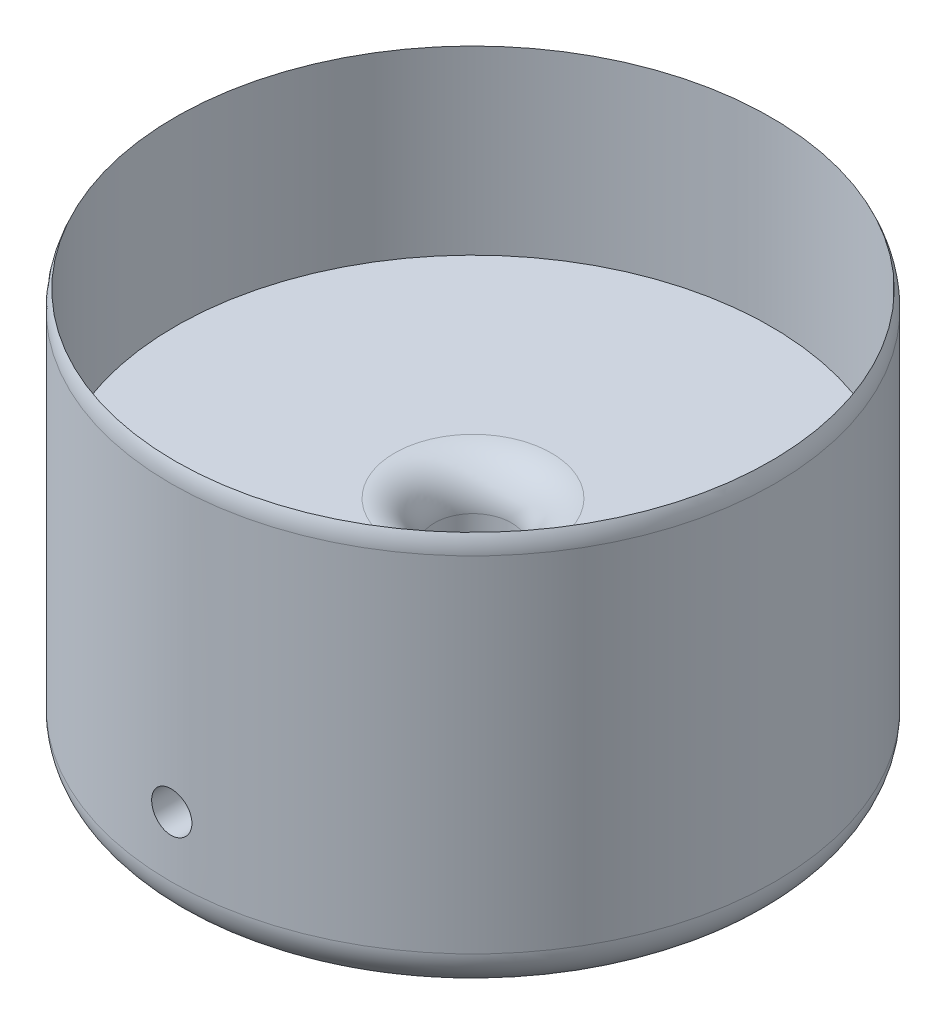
ISO-10303-21;
HEADER;
FILE_DESCRIPTION(('STEP AP214'),'2;1');
FILE_NAME('part.step','',(''),(''),'','','');
FILE_SCHEMA(('AUTOMOTIVE_DESIGN { 1 0 10303 214 1 1 1 1 }'));
ENDSEC;
DATA;
#1=APPLICATION_CONTEXT('core data for automotive mechanical design processes');
#2=APPLICATION_PROTOCOL_DEFINITION('international standard','automotive_design',2000,#1);
#3=PRODUCT_CONTEXT('',#1,'mechanical');
#4=PRODUCT('Part','Part','',(#3));
#5=PRODUCT_RELATED_PRODUCT_CATEGORY('part','',(#4));
#6=PRODUCT_DEFINITION_FORMATION('','',#4);
#7=PRODUCT_DEFINITION_CONTEXT('part definition',#1,'design');
#8=PRODUCT_DEFINITION('design','',#6,#7);
#9=PRODUCT_DEFINITION_SHAPE('','',#8);
#10=(LENGTH_UNIT() NAMED_UNIT(*) SI_UNIT(.MILLI.,.METRE.));
#11=(NAMED_UNIT(*) PLANE_ANGLE_UNIT() SI_UNIT($,.RADIAN.));
#12=(NAMED_UNIT(*) SI_UNIT($,.STERADIAN.) SOLID_ANGLE_UNIT());
#13=UNCERTAINTY_MEASURE_WITH_UNIT(LENGTH_MEASURE(1.E-05),#10,'distance_accuracy_value','');
#14=(GEOMETRIC_REPRESENTATION_CONTEXT(3) GLOBAL_UNCERTAINTY_ASSIGNED_CONTEXT((#13)) GLOBAL_UNIT_ASSIGNED_CONTEXT((#10,
#11,#12)) REPRESENTATION_CONTEXT('',''));
#15=CARTESIAN_POINT('',(0.,0.,0.));
#16=DIRECTION('',(0.,0.,1.));
#17=DIRECTION('',(1.,0.,0.));
#18=AXIS2_PLACEMENT_3D('',#15,#16,#17);
#19=CARTESIAN_POINT('',(0.,100.,0.));
#20=DIRECTION('',(0.,-1.,0.));
#21=DIRECTION('',(0.,0.,-1.));
#22=AXIS2_PLACEMENT_3D('',#19,#20,#21);
#23=CYLINDRICAL_SURFACE('',#22,75.);
#24=CARTESIAN_POINT('',(0.,30.0000000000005,-75.));
#25=CARTESIAN_POINT('',(-0.140309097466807,30.0000011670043,-75.0000002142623));
#26=CARTESIAN_POINT('',(-0.280599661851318,29.9940916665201,-74.9996054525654));
#27=CARTESIAN_POINT('',(-0.56022812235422,29.9704960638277,-74.9980378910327));
#28=CARTESIAN_POINT('',(-0.699565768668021,29.9528069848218,-74.9968648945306));
#29=CARTESIAN_POINT('',(-0.976366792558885,29.9057552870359,-74.9937723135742));
#30=CARTESIAN_POINT('',(-1.11382847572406,29.8763827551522,-74.9918520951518));
#31=CARTESIAN_POINT('',(-1.38583180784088,29.8061633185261,-74.9873187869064));
#32=CARTESIAN_POINT('',(-1.52037236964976,29.7653122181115,-74.9847054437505));
#33=CARTESIAN_POINT('',(-1.7854045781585,29.6724755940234,-74.9788629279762));
#34=CARTESIAN_POINT('',(-1.91589977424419,29.6205001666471,-74.975634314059));
#35=CARTESIAN_POINT('',(-2.17209218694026,29.5057434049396,-74.968649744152));
#36=CARTESIAN_POINT('',(-2.29778761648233,29.4429580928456,-74.9648935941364));
#37=CARTESIAN_POINT('',(-2.54336741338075,29.3070829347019,-74.9569634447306));
#38=CARTESIAN_POINT('',(-2.66325520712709,29.2339992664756,-74.9527896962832));
#39=CARTESIAN_POINT('',(-2.89649799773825,29.0779887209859,-74.9441387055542));
#40=CARTESIAN_POINT('',(-3.00985056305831,28.9950582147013,-74.9396613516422));
#41=CARTESIAN_POINT('',(-3.22929868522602,28.8198644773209,-74.9305258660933));
#42=CARTESIAN_POINT('',(-3.33538597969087,28.7275909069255,-74.9258675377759));
#43=CARTESIAN_POINT('',(-3.53945256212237,28.5344057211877,-74.9165049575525));
#44=CARTESIAN_POINT('',(-3.63742884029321,28.4334909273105,-74.9118006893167));
#45=CARTESIAN_POINT('',(-3.82450593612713,28.2238005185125,-74.9024827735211));
#46=CARTESIAN_POINT('',(-3.9136096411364,28.115027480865,-74.8978690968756));
#47=CARTESIAN_POINT('',(-4.08237803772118,27.8903185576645,-74.8888598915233));
#48=CARTESIAN_POINT('',(-4.16203923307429,27.7743800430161,-74.8844644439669));
#49=CARTESIAN_POINT('',(-4.31135978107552,27.5361292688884,-74.8760160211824));
#50=CARTESIAN_POINT('',(-4.38101356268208,27.4138135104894,-74.8719632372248));
#51=CARTESIAN_POINT('',(-4.50979330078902,27.1636916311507,-74.8643167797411));
#52=CARTESIAN_POINT('',(-4.56891535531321,27.0358834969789,-74.860723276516));
#53=CARTESIAN_POINT('',(-4.67615623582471,26.7757632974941,-74.8541011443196));
#54=CARTESIAN_POINT('',(-4.72427922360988,26.6434529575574,-74.8510723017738));
#55=CARTESIAN_POINT('',(-4.80921896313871,26.3752242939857,-74.8456625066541));
#56=CARTESIAN_POINT('',(-4.84603154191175,26.2393046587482,-74.843281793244));
#57=CARTESIAN_POINT('',(-4.93892346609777,25.8280860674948,-74.8372307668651));
#58=CARTESIAN_POINT('',(-4.97773600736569,25.5486487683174,-74.8346337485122));
#59=CARTESIAN_POINT('',(-5.00788806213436,24.9873661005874,-74.8326215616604));
#60=CARTESIAN_POINT('',(-4.99922817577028,24.7055207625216,-74.8332063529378));
#61=CARTESIAN_POINT('',(-4.93480047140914,24.1477119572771,-74.8374824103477));
#62=CARTESIAN_POINT('',(-4.87910802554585,23.8717398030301,-74.841168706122));
#63=CARTESIAN_POINT('',(-4.72229658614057,23.3330805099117,-74.851225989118));
#64=CARTESIAN_POINT('',(-4.62117728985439,23.0703934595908,-74.8575969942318));
#65=CARTESIAN_POINT('',(-4.37630158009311,22.5655059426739,-74.8723110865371));
#66=CARTESIAN_POINT('',(-4.232511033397,22.3233220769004,-74.8806557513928));
#67=CARTESIAN_POINT('',(-3.90639803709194,21.8665007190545,-74.8983753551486));
#68=CARTESIAN_POINT('',(-3.72407509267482,21.6518635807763,-74.9077503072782));
#69=CARTESIAN_POINT('',(-3.32564878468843,21.2557888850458,-74.9264960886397));
#70=CARTESIAN_POINT('',(-3.1094801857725,21.0744169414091,-74.9358668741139));
#71=CARTESIAN_POINT('',(-2.64972721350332,20.7505276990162,-74.9535307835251));
#72=CARTESIAN_POINT('',(-2.4061428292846,20.608010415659,-74.9618239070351));
#73=CARTESIAN_POINT('',(-1.89843247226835,20.3658812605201,-74.9763988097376));
#74=CARTESIAN_POINT('',(-1.63430527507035,20.2662719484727,-74.9826804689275));
#75=CARTESIAN_POINT('',(-1.09302498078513,20.1128305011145,-74.9925230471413));
#76=CARTESIAN_POINT('',(-0.815872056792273,20.0589977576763,-74.9960840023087));
#77=CARTESIAN_POINT('',(-0.256976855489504,19.9987190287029,-75.0000792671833));
#78=CARTESIAN_POINT('',(0.0247555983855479,19.9921823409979,-75.0005195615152));
#79=CARTESIAN_POINT('',(0.58531285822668,20.0264441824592,-74.9982398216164));
#80=CARTESIAN_POINT('',(0.864137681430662,20.0672424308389,-74.9955198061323));
#81=CARTESIAN_POINT('',(1.41070880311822,20.1949408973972,-74.9872294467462));
#82=CARTESIAN_POINT('',(1.67846488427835,20.2817994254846,-74.9816616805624));
#83=CARTESIAN_POINT('',(2.1956000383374,20.4991105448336,-74.9683020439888));
#84=CARTESIAN_POINT('',(2.44497892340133,20.6295635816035,-74.9605101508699));
#85=CARTESIAN_POINT('',(2.91869566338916,20.9305907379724,-74.9435624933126));
#86=CARTESIAN_POINT('',(3.14299500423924,21.1012253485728,-74.9344046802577));
#87=CARTESIAN_POINT('',(3.55979761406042,21.4776850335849,-74.915762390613));
#88=CARTESIAN_POINT('',(3.75230052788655,21.6835105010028,-74.9062779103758));
#89=CARTESIAN_POINT('',(4.10035416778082,22.1248972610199,-74.8880337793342));
#90=CARTESIAN_POINT('',(4.25584598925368,22.3605050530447,-74.8792752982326));
#91=CARTESIAN_POINT('',(4.52505903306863,22.85454907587,-74.8634898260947));
#92=CARTESIAN_POINT('',(4.63878054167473,23.1129851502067,-74.8564628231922));
#93=CARTESIAN_POINT('',(4.82112861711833,23.6450835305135,-74.8449403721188));
#94=CARTESIAN_POINT('',(4.88979207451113,23.9187331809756,-74.8404428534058));
#95=CARTESIAN_POINT('',(4.98017484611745,24.4738611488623,-74.834484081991));
#96=CARTESIAN_POINT('',(5.00189470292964,24.755339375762,-74.8330227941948));
#97=CARTESIAN_POINT('',(4.99885527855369,25.176740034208,-74.8332233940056));
#98=CARTESIAN_POINT('',(4.99191643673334,25.3170094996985,-74.8336882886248));
#99=CARTESIAN_POINT('',(4.96627572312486,25.5964503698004,-74.8353947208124));
#100=CARTESIAN_POINT('',(4.94757820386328,25.7356221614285,-74.8366359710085));
#101=CARTESIAN_POINT('',(4.89854032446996,26.0119332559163,-74.8398616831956));
#102=CARTESIAN_POINT('',(4.86819566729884,26.1490717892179,-74.8418464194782));
#103=CARTESIAN_POINT('',(4.79609789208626,26.4202530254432,-74.8465012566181));
#104=CARTESIAN_POINT('',(4.75434896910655,26.5542968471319,-74.8491711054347));
#105=CARTESIAN_POINT('',(4.65971948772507,26.8184342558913,-74.8551218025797));
#106=CARTESIAN_POINT('',(4.60683502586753,26.948526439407,-74.8584028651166));
#107=CARTESIAN_POINT('',(4.49034262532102,27.2037450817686,-74.8654808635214));
#108=CARTESIAN_POINT('',(4.42673863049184,27.3288733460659,-74.8692776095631));
#109=CARTESIAN_POINT('',(4.28922238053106,27.5733734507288,-74.8772816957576));
#110=CARTESIAN_POINT('',(4.2153066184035,27.6927433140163,-74.8814891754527));
#111=CARTESIAN_POINT('',(4.0577364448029,27.9247969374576,-74.8901929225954));
#112=CARTESIAN_POINT('',(3.97408560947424,28.0374831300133,-74.8946890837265));
#113=CARTESIAN_POINT('',(3.79741993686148,28.2556640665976,-74.9038546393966));
#114=CARTESIAN_POINT('',(3.70438488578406,28.3611424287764,-74.9085243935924));
#115=CARTESIAN_POINT('',(3.50979940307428,28.5638517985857,-74.9178936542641));
#116=CARTESIAN_POINT('',(3.4082521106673,28.6610858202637,-74.9225931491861));
#117=CARTESIAN_POINT('',(3.19726521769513,28.8467195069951,-74.9318934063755));
#118=CARTESIAN_POINT('',(3.08782081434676,28.9351137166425,-74.9364941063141));
#119=CARTESIAN_POINT('',(2.86191065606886,29.1023420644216,-74.9454617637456));
#120=CARTESIAN_POINT('',(2.74544750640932,29.181179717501,-74.9498288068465));
#121=CARTESIAN_POINT('',(2.50608067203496,29.3288997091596,-74.9582145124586));
#122=CARTESIAN_POINT('',(2.38316626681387,29.3977647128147,-74.962232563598));
#123=CARTESIAN_POINT('',(2.13200113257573,29.5248617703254,-74.9697962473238));
#124=CARTESIAN_POINT('',(2.00375237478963,29.5830977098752,-74.9733420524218));
#125=CARTESIAN_POINT('',(1.74289730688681,29.6885049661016,-74.9798593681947));
#126=CARTESIAN_POINT('',(1.61029484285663,29.7356857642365,-74.9828313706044));
#127=CARTESIAN_POINT('',(1.3416176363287,29.8186960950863,-74.9881198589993));
#128=CARTESIAN_POINT('',(1.20554378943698,29.8545285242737,-74.9904365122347));
#129=CARTESIAN_POINT('',(0.892938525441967,29.9228877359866,-74.9948887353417));
#130=CARTESIAN_POINT('',(0.7155969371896,29.9517788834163,-74.996798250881));
#131=CARTESIAN_POINT('',(0.358826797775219,29.9903342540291,-74.9993537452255));
#132=CARTESIAN_POINT('',(0.179398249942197,29.9999985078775,-74.9999997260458));
#133=CARTESIAN_POINT('',(0.,30.0000000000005,-75.));
#134=B_SPLINE_CURVE_WITH_KNOTS('',3,(#24,#25,#26,#27,#28,#29,#30,#31,#32,#33,#34,#35,#36,#37,
#38,#39,#40,#41,#42,#43,#44,#45,#46,#47,#48,#49,#50,#51,#52,#53,#54,#55,#56,#57,#58,#59,#60,#61,
#62,#63,#64,#65,#66,#67,#68,#69,#70,#71,#72,#73,#74,#75,#76,#77,#78,#79,#80,#81,#82,#83,#84,#85,
#86,#87,#88,#89,#90,#91,#92,#93,#94,#95,#96,#97,#98,#99,#100,#101,#102,#103,#104,#105,#106,#107,
#108,#109,#110,#111,#112,#113,#114,#115,#116,#117,#118,#119,#120,#121,#122,#123,#124,#125,#126,
#127,#128,#129,#130,#131,#132,#133),.UNSPECIFIED.,.T.,.F.,(4,2,2,2,2,2,2,2,2,2,2,2,2,2,2,2,2,2,
2,2,2,2,2,2,2,2,2,2,2,2,2,2,2,2,2,2,2,2,2,2,2,2,2,2,2,2,2,2,2,2,2,2,2,2,4),(0.,
0.420770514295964,0.841647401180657,1.26288215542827,1.68427108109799,2.10527916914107,
2.52644250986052,2.94735426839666,3.36842163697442,3.78996017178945,4.2116544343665,
4.63321101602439,5.05492320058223,5.47686924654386,5.89897129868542,6.32091337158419,
6.74301093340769,7.5850319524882,8.42704232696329,9.26770589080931,10.1083750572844,
10.9497185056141,11.7910727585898,12.6340690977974,13.4770657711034,14.3201127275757,
15.1631484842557,16.0045670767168,16.8459806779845,17.6866339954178,18.5272959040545,
19.3692315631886,20.2111766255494,21.0544528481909,21.897723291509,22.7403024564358,
23.5828718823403,24.0037877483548,24.4245479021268,24.8454634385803,25.2662243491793,
25.6871329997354,26.1078871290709,26.5287847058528,26.9495281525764,27.3711980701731,
27.7927131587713,28.2144867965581,28.6361048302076,29.0584471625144,29.4806347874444,
29.9024589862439,30.3241754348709,30.8621705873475,31.4001648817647),.UNSPECIFIED.);
#135=CARTESIAN_POINT('',(0.,30.0000000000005,-75.));
#136=VERTEX_POINT('',#135);
#137=EDGE_CURVE('E73',#136,#136,#134,.T.);
#138=ORIENTED_EDGE('',*,*,#137,.T.);
#139=EDGE_LOOP('',(#138));
#140=FACE_BOUND('',#139,.T.);
#141=CARTESIAN_POINT('',(5.,25.0000000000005,74.8331477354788));
#142=CARTESIAN_POINT('',(5.000001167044,24.8596912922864,74.8331475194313));
#143=CARTESIAN_POINT('',(4.99409169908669,24.7194011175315,74.8335431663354));
#144=CARTESIAN_POINT('',(4.97049622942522,24.4397734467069,74.8351141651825));
#145=CARTESIAN_POINT('',(4.95280725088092,24.3004362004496,74.8362897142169));
#146=CARTESIAN_POINT('',(4.90575582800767,24.0236359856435,74.8393887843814));
#147=CARTESIAN_POINT('',(4.87638347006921,23.8861747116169,74.8413129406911));
#148=CARTESIAN_POINT('',(4.80616446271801,23.6141722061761,74.8458550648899));
#149=CARTESIAN_POINT('',(4.76531361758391,23.4796320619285,74.8484732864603));
#150=CARTESIAN_POINT('',(4.67247761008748,23.2146007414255,74.854325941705));
#151=CARTESIAN_POINT('',(4.62050254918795,23.0841060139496,74.8575598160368));
#152=CARTESIAN_POINT('',(4.50574660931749,22.8279144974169,74.8645547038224));
#153=CARTESIAN_POINT('',(4.44296175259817,22.7022194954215,74.8683159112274));
#154=CARTESIAN_POINT('',(4.30708757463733,22.4566404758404,74.8762553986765));
#155=CARTESIAN_POINT('',(4.23400443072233,22.3367530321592,74.8804334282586));
#156=CARTESIAN_POINT('',(4.07799498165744,22.1035108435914,74.8890917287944));
#157=CARTESIAN_POINT('',(3.99506504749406,21.9901585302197,74.8935721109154));
#158=CARTESIAN_POINT('',(3.81987187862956,21.7707100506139,74.9027120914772));
#159=CARTESIAN_POINT('',(3.72759824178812,21.6646221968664,74.9073718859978));
#160=CARTESIAN_POINT('',(3.53441280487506,21.4605544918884,74.9167356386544));
#161=CARTESIAN_POINT('',(3.43349782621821,21.3625776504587,74.9214396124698));
#162=CARTESIAN_POINT('',(3.22380693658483,21.1754994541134,74.9307552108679));
#163=CARTESIAN_POINT('',(3.11503360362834,21.0863952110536,74.9353668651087));
#164=CARTESIAN_POINT('',(2.89032398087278,20.9176257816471,74.9443705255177));
#165=CARTESIAN_POINT('',(2.7743850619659,20.8379640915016,74.9487624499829));
#166=CARTESIAN_POINT('',(2.53613397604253,20.6886429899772,74.9572026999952));
#167=CARTESIAN_POINT('',(2.41381834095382,20.6189891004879,74.961250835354));
#168=CARTESIAN_POINT('',(2.16369670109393,20.4902091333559,74.9688874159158));
#169=CARTESIAN_POINT('',(2.03588868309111,20.4310869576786,74.9724756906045));
#170=CARTESIAN_POINT('',(1.77576872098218,20.32384582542,74.9790873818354));
#171=CARTESIAN_POINT('',(1.64345850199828,20.2757227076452,74.982111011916));
#172=CARTESIAN_POINT('',(1.37523010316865,20.1907827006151,74.9875109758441));
#173=CARTESIAN_POINT('',(1.23931061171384,20.153969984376,74.9898870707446));
#174=CARTESIAN_POINT('',(0.828092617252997,20.0610776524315,74.9959259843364));
#175=CARTESIAN_POINT('',(0.548655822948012,20.0222647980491,74.9985172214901));
#176=CARTESIAN_POINT('',(-0.0126258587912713,19.9921119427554,75.0005250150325));
#177=CARTESIAN_POINT('',(-0.294470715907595,20.0007713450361,74.9999416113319));
#178=CARTESIAN_POINT('',(-0.852281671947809,20.0651982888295,74.9956748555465));
#179=CARTESIAN_POINT('',(-1.12825640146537,20.120890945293,74.9919964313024));
#180=CARTESIAN_POINT('',(-1.66692073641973,20.2777037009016,74.9819579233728));
#181=CARTESIAN_POINT('',(-1.92961025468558,20.3788240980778,74.975597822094));
#182=CARTESIAN_POINT('',(-2.43450074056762,20.6237020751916,74.9609038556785));
#183=CARTESIAN_POINT('',(-2.67668523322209,20.7674935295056,74.9525684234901));
#184=CARTESIAN_POINT('',(-3.13350745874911,21.093608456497,74.9348615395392));
#185=CARTESIAN_POINT('',(-3.34814483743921,21.27593242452,74.9254900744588));
#186=CARTESIAN_POINT('',(-3.74421835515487,21.6743594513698,74.9067440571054));
#187=CARTESIAN_POINT('',(-3.92558908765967,21.8905275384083,74.8973695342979));
#188=CARTESIAN_POINT('',(-4.24947613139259,22.3502790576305,74.8796924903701));
#189=CARTESIAN_POINT('',(-4.3919924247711,22.5938625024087,74.8713899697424));
#190=CARTESIAN_POINT('',(-4.63412087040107,23.1015726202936,74.8567946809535));
#191=CARTESIAN_POINT('',(-4.73373015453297,23.3657006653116,74.8505020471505));
#192=CARTESIAN_POINT('',(-4.88717128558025,23.906982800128,74.8406408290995));
#193=CARTESIAN_POINT('',(-4.94100374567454,24.1841367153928,74.8370722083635));
#194=CARTESIAN_POINT('',(-5.00128140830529,24.7430323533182,74.8330683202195));
#195=CARTESIAN_POINT('',(-5.00781758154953,25.0247642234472,74.8326270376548));
#196=CARTESIAN_POINT('',(-4.97355491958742,25.5853201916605,74.8349118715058));
#197=CARTESIAN_POINT('',(-4.93275636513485,25.8641443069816,74.8376379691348));
#198=CARTESIAN_POINT('',(-4.80505800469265,26.4107120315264,74.8459448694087));
#199=CARTESIAN_POINT('',(-4.71820019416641,26.6784654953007,74.8515230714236));
#200=CARTESIAN_POINT('',(-4.50089138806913,27.1955957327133,74.8649033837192));
#201=CARTESIAN_POINT('',(-4.37043994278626,27.4449723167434,74.8727055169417));
#202=CARTESIAN_POINT('',(-4.06941510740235,27.9186875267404,74.8896690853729));
#203=CARTESIAN_POINT('',(-3.89878082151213,28.1429873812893,74.8988325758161));
#204=CARTESIAN_POINT('',(-3.52232149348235,28.559791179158,74.9174790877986));
#205=CARTESIAN_POINT('',(-3.31649606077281,28.7522947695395,74.9269621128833));
#206=CARTESIAN_POINT('',(-2.87510899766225,29.1003498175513,74.9451968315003));
#207=CARTESIAN_POINT('',(-2.63950086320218,29.2558423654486,74.9539473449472));
#208=CARTESIAN_POINT('',(-2.1454559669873,29.5250566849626,74.9697138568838));
#209=CARTESIAN_POINT('',(-1.88701936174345,29.6387787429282,74.9767298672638));
#210=CARTESIAN_POINT('',(-1.35492136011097,29.821127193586,74.9882321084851));
#211=CARTESIAN_POINT('',(-1.08127270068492,29.8897907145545,74.9927204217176));
#212=CARTESIAN_POINT('',(-0.526146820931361,29.9801739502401,74.9986666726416));
#213=CARTESIAN_POINT('',(-0.24466969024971,30.0018942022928,75.0001246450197));
#214=CARTESIAN_POINT('',(0.176730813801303,29.9988556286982,74.9999245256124));
#215=CARTESIAN_POINT('',(0.317001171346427,29.9919169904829,74.9994606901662));
#216=CARTESIAN_POINT('',(0.596443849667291,29.966276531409,74.9977580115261));
#217=CARTESIAN_POINT('',(0.735616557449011,29.9475790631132,74.9965194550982));
#218=CARTESIAN_POINT('',(1.01192949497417,29.8985411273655,74.9933004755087));
#219=CARTESIAN_POINT('',(1.14906895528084,29.8681963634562,74.9913197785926));
#220=CARTESIAN_POINT('',(1.42025204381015,29.7960982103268,74.986673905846));
#221=CARTESIAN_POINT('',(1.55429679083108,29.754349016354,74.9840089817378));
#222=CARTESIAN_POINT('',(1.81843603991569,29.6597188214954,74.9780684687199));
#223=CARTESIAN_POINT('',(1.94852913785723,29.6068339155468,74.9747926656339));
#224=CARTESIAN_POINT('',(2.2037495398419,29.4903404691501,74.9677249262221));
#225=CARTESIAN_POINT('',(2.32887864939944,29.4267358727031,74.9639331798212));
#226=CARTESIAN_POINT('',(2.57338033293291,29.289218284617,74.9559382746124));
#227=CARTESIAN_POINT('',(2.69275093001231,29.2153017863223,74.951734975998));
#228=CARTESIAN_POINT('',(2.9248058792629,29.0577300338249,74.9430383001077));
#229=CARTESIAN_POINT('',(3.03749266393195,28.9740783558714,74.9385450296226));
#230=CARTESIAN_POINT('',(3.25567352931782,28.7974118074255,74.9293836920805));
#231=CARTESIAN_POINT('',(3.36115130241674,28.7043768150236,74.9247152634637));
#232=CARTESIAN_POINT('',(3.56385949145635,28.5097915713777,74.9153468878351));
#233=CARTESIAN_POINT('',(3.66109292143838,28.4082444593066,74.9106469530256));
#234=CARTESIAN_POINT('',(3.84672545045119,28.1972580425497,74.9013441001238));
#235=CARTESIAN_POINT('',(3.93511909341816,28.0878139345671,74.8967412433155));
#236=CARTESIAN_POINT('',(4.10234635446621,27.8619044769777,74.887767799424));
#237=CARTESIAN_POINT('',(4.18118348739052,27.7454417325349,74.8833971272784));
#238=CARTESIAN_POINT('',(4.32890289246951,27.5060751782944,74.8750030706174));
#239=CARTESIAN_POINT('',(4.39776777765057,27.3831606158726,74.8709802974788));
#240=CARTESIAN_POINT('',(4.5248645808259,27.1319951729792,74.8634066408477));
#241=CARTESIAN_POINT('',(4.58310038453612,27.0037462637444,74.8598555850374));
#242=CARTESIAN_POINT('',(4.68850735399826,26.7428908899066,74.8533278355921));
#243=CARTESIAN_POINT('',(4.73568800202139,26.6102882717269,74.8503506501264));
#244=CARTESIAN_POINT('',(4.81869801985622,26.3416107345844,74.8450524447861));
#245=CARTESIAN_POINT('',(4.85453028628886,26.2055367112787,74.8427312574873));
#246=CARTESIAN_POINT('',(4.92288879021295,25.8929324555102,74.8382700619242));
#247=CARTESIAN_POINT('',(4.95177954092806,25.7155920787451,74.8363564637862));
#248=CARTESIAN_POINT('',(4.99033438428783,25.3588243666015,74.8337954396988));
#249=CARTESIAN_POINT('',(4.99999850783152,25.1793970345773,74.8331480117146));
#250=CARTESIAN_POINT('',(5.,25.0000000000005,74.8331477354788));
#251=B_SPLINE_CURVE_WITH_KNOTS('',3,(#141,#142,#143,#144,#145,#146,#147,#148,#149,#150,#151,
#152,#153,#154,#155,#156,#157,#158,#159,#160,#161,#162,#163,#164,#165,#166,#167,#168,#169,#170,
#171,#172,#173,#174,#175,#176,#177,#178,#179,#180,#181,#182,#183,#184,#185,#186,#187,#188,#189,
#190,#191,#192,#193,#194,#195,#196,#197,#198,#199,#200,#201,#202,#203,#204,#205,#206,#207,#208,
#209,#210,#211,#212,#213,#214,#215,#216,#217,#218,#219,#220,#221,#222,#223,#224,#225,#226,#227,
#228,#229,#230,#231,#232,#233,#234,#235,#236,#237,#238,#239,#240,#241,#242,#243,#244,#245,#246,
#247,#248,#249,#250),.UNSPECIFIED.,.T.,.F.,(4,2,2,2,2,2,2,2,2,2,2,2,2,2,2,2,2,2,2,2,2,2,2,2,2,2,
2,2,2,2,2,2,2,2,2,2,2,2,2,2,2,2,2,2,2,2,2,2,2,2,2,2,2,2,4),(0.,0.420769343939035,
0.84164506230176,1.26287866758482,1.68426644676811,2.1052731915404,2.52643518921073,
2.94734562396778,3.3684116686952,3.78995174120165,4.21164754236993,4.63320562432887,
5.05491930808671,5.47686478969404,5.89896627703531,6.32090780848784,6.74300483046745,
7.58502440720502,8.42703339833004,9.26770428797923,10.108380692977,10.9497262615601,
11.7910826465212,12.6340759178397,13.4770695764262,14.3201195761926,15.1631582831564,
16.0045750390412,16.8459868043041,17.6866327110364,18.5272872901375,19.36922414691,
20.2111703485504,21.0544478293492,21.8977195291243,22.7402954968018,23.5828618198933,
24.0037803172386,24.4245431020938,24.8454612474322,25.2662247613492,25.6871360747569,
26.1078928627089,26.5287930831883,26.9495391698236,27.3712075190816,27.7927210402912,
28.2144931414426,28.6361096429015,29.0584526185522,29.4806408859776,29.902465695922,
30.3241827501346,30.8621742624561,31.4001649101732),.UNSPECIFIED.);
#252=CARTESIAN_POINT('',(5.,25.0000000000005,74.8331477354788));
#253=VERTEX_POINT('',#252);
#254=EDGE_CURVE('E68',#253,#253,#251,.T.);
#255=ORIENTED_EDGE('',*,*,#254,.T.);
#256=EDGE_LOOP('',(#255));
#257=FACE_BOUND('',#256,.T.);
#258=CARTESIAN_POINT('',(0.,9.99999999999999,0.));
#259=DIRECTION('',(0.,1.,0.));
#260=DIRECTION('',(0.,0.,1.));
#261=AXIS2_PLACEMENT_3D('',#258,#259,#260);
#262=CIRCLE('',#261,75.);
#263=CARTESIAN_POINT('',(0.,9.99999999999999,75.));
#264=VERTEX_POINT('',#263);
#265=EDGE_CURVE('E104',#264,#264,#262,.T.);
#266=ORIENTED_EDGE('',*,*,#265,.T.);
#267=EDGE_LOOP('',(#266));
#268=FACE_BOUND('',#267,.T.);
#269=CARTESIAN_POINT('',(0.,95.6411010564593,0.));
#270=DIRECTION('',(0.,1.,0.));
#271=DIRECTION('',(0.,0.,1.));
#272=AXIS2_PLACEMENT_3D('',#269,#270,#271);
#273=CIRCLE('',#272,75.);
#274=CARTESIAN_POINT('',(0.,95.6411010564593,75.));
#275=VERTEX_POINT('',#274);
#276=EDGE_CURVE('E106',#275,#275,#273,.F.);
#277=ORIENTED_EDGE('',*,*,#276,.T.);
#278=EDGE_LOOP('',(#277));
#279=FACE_BOUND('',#278,.T.);
#280=ADVANCED_FACE('F31',(#140,#257,#268,#279),#23,.T.);
#281=CARTESIAN_POINT('',(0.,0.,0.));
#282=DIRECTION('',(0.,1.,0.));
#283=DIRECTION('',(0.,0.,1.));
#284=AXIS2_PLACEMENT_3D('',#281,#282,#283);
#285=PLANE('',#284);
#286=CARTESIAN_POINT('',(0.,0.,0.));
#287=DIRECTION('',(0.,1.,0.));
#288=DIRECTION('',(0.,0.,1.));
#289=AXIS2_PLACEMENT_3D('',#286,#287,#288);
#290=CIRCLE('',#289,65.);
#291=CARTESIAN_POINT('',(0.,0.,65.));
#292=VERTEX_POINT('',#291);
#293=EDGE_CURVE('E48',#292,#292,#290,.F.);
#294=ORIENTED_EDGE('',*,*,#293,.T.);
#295=EDGE_LOOP('',(#294));
#296=FACE_BOUND('',#295,.T.);
#297=CARTESIAN_POINT('',(0.,0.,0.));
#298=DIRECTION('',(0.,1.,0.));
#299=DIRECTION('',(0.,0.,1.));
#300=AXIS2_PLACEMENT_3D('',#297,#298,#299);
#301=CIRCLE('',#300,30.);
#302=CARTESIAN_POINT('',(0.,0.,30.));
#303=VERTEX_POINT('',#302);
#304=EDGE_CURVE('E109',#303,#303,#301,.T.);
#305=ORIENTED_EDGE('',*,*,#304,.T.);
#306=EDGE_LOOP('',(#305));
#307=FACE_BOUND('',#306,.T.);
#308=ADVANCED_FACE('F81',(#296,#307),#285,.F.);
#309=CARTESIAN_POINT('',(0.,55.,0.));
#310=DIRECTION('',(0.,1.,0.));
#311=DIRECTION('',(0.,0.,1.));
#312=AXIS2_PLACEMENT_3D('',#309,#310,#311);
#313=CYLINDRICAL_SURFACE('',#312,74.);
#314=CARTESIAN_POINT('',(0.,55.,0.));
#315=DIRECTION('',(0.,1.,0.));
#316=DIRECTION('',(0.,0.,1.));
#317=AXIS2_PLACEMENT_3D('',#314,#315,#316);
#318=CIRCLE('',#317,74.);
#319=CARTESIAN_POINT('',(0.,55.,74.));
#320=VERTEX_POINT('',#319);
#321=EDGE_CURVE('E114',#320,#320,#318,.T.);
#322=CARTESIAN_POINT('',(0.,100.,0.));
#323=DIRECTION('',(0.,1.,0.));
#324=DIRECTION('',(0.,0.,1.));
#325=AXIS2_PLACEMENT_3D('',#322,#323,#324);
#326=CIRCLE('',#325,74.);
#327=CARTESIAN_POINT('',(0.,100.,74.));
#328=VERTEX_POINT('',#327);
#329=EDGE_CURVE('E115',#328,#328,#326,.T.);
#330=CARTESIAN_POINT('',(0.,55.,74.));
#331=CARTESIAN_POINT('',(0.,55.46875,74.));
#332=CARTESIAN_POINT('',(0.,55.9375,74.));
#333=CARTESIAN_POINT('',(0.,56.875,74.));
#334=CARTESIAN_POINT('',(0.,57.34375,74.));
#335=CARTESIAN_POINT('',(0.,58.28125,74.));
#336=CARTESIAN_POINT('',(0.,58.75,74.));
#337=CARTESIAN_POINT('',(0.,59.6875,74.));
#338=CARTESIAN_POINT('',(0.,60.15625,74.));
#339=CARTESIAN_POINT('',(0.,61.09375,74.));
#340=CARTESIAN_POINT('',(0.,61.5625,74.));
#341=CARTESIAN_POINT('',(0.,62.5,74.));
#342=CARTESIAN_POINT('',(0.,62.96875,74.));
#343=CARTESIAN_POINT('',(0.,63.90625,74.));
#344=CARTESIAN_POINT('',(0.,64.375,74.));
#345=CARTESIAN_POINT('',(0.,65.3125,74.));
#346=CARTESIAN_POINT('',(0.,65.78125,74.));
#347=CARTESIAN_POINT('',(0.,66.71875,74.));
#348=CARTESIAN_POINT('',(0.,67.1875,74.));
#349=CARTESIAN_POINT('',(0.,68.125,74.));
#350=CARTESIAN_POINT('',(0.,68.59375,74.));
#351=CARTESIAN_POINT('',(0.,69.53125,74.));
#352=CARTESIAN_POINT('',(0.,70.,74.));
#353=CARTESIAN_POINT('',(0.,70.9375,74.));
#354=CARTESIAN_POINT('',(0.,71.40625,74.));
#355=CARTESIAN_POINT('',(0.,72.34375,74.));
#356=CARTESIAN_POINT('',(0.,72.8125,74.));
#357=CARTESIAN_POINT('',(0.,73.75,74.));
#358=CARTESIAN_POINT('',(0.,74.21875,74.));
#359=CARTESIAN_POINT('',(0.,75.15625,74.));
#360=CARTESIAN_POINT('',(0.,75.625,74.));
#361=CARTESIAN_POINT('',(0.,76.5625,74.));
#362=CARTESIAN_POINT('',(0.,77.03125,74.));
#363=CARTESIAN_POINT('',(0.,77.96875,74.));
#364=CARTESIAN_POINT('',(0.,78.4375,74.));
#365=CARTESIAN_POINT('',(0.,79.375,74.));
#366=CARTESIAN_POINT('',(0.,79.84375,74.));
#367=CARTESIAN_POINT('',(0.,80.78125,74.));
#368=CARTESIAN_POINT('',(0.,81.25,74.));
#369=CARTESIAN_POINT('',(0.,82.1875,74.));
#370=CARTESIAN_POINT('',(0.,82.65625,74.));
#371=CARTESIAN_POINT('',(0.,83.59375,74.));
#372=CARTESIAN_POINT('',(0.,84.0625,74.));
#373=CARTESIAN_POINT('',(0.,85.,74.));
#374=CARTESIAN_POINT('',(0.,85.46875,74.));
#375=CARTESIAN_POINT('',(0.,86.40625,74.));
#376=CARTESIAN_POINT('',(0.,86.875,74.));
#377=CARTESIAN_POINT('',(0.,87.8125,74.));
#378=CARTESIAN_POINT('',(0.,88.28125,74.));
#379=CARTESIAN_POINT('',(0.,89.21875,74.));
#380=CARTESIAN_POINT('',(0.,89.6875,74.));
#381=CARTESIAN_POINT('',(0.,90.625,74.));
#382=CARTESIAN_POINT('',(0.,91.09375,74.));
#383=CARTESIAN_POINT('',(0.,92.03125,74.));
#384=CARTESIAN_POINT('',(0.,92.5,74.));
#385=CARTESIAN_POINT('',(0.,93.4375,74.));
#386=CARTESIAN_POINT('',(0.,93.90625,74.));
#387=CARTESIAN_POINT('',(0.,94.84375,74.));
#388=CARTESIAN_POINT('',(0.,95.3125,74.));
#389=CARTESIAN_POINT('',(0.,96.25,74.));
#390=CARTESIAN_POINT('',(0.,96.71875,74.));
#391=CARTESIAN_POINT('',(0.,97.65625,74.));
#392=CARTESIAN_POINT('',(0.,98.125,74.));
#393=CARTESIAN_POINT('',(0.,99.0625,74.));
#394=CARTESIAN_POINT('',(0.,99.53125,74.));
#395=CARTESIAN_POINT('',(0.,100.,74.));
#396=B_SPLINE_CURVE_WITH_KNOTS('',3,(#330,#331,#332,#333,#334,#335,#336,#337,#338,#339,#340,
#341,#342,#343,#344,#345,#346,#347,#348,#349,#350,#351,#352,#353,#354,#355,#356,#357,#358,#359,
#360,#361,#362,#363,#364,#365,#366,#367,#368,#369,#370,#371,#372,#373,#374,#375,#376,#377,#378,
#379,#380,#381,#382,#383,#384,#385,#386,#387,#388,#389,#390,#391,#392,#393,#394,#395),
.UNSPECIFIED.,.F.,.F.,(4,2,2,2,2,2,2,2,2,2,2,2,2,2,2,2,2,2,2,2,2,2,2,2,2,2,2,2,2,2,2,2,4),(0.,
1.40625,2.8125,4.21874999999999,5.625,7.03125,8.4375,9.84375,11.25,12.65625,14.0625,15.46875,
16.875,18.28125,19.6875,21.09375,22.5,23.90625,25.3125,26.71875,28.125,29.53125,30.9375,
32.34375,33.75,35.15625,36.5625,37.96875,39.375,40.78125,42.1875,43.59375,45.),.UNSPECIFIED.);
#397=EDGE_CURVE('BSEAM136',#320,#328,#396,.T.);
#398=ORIENTED_EDGE('',*,*,#321,.F.);
#399=ORIENTED_EDGE('',*,*,#329,.T.);
#400=ORIENTED_EDGE('',*,*,#397,.T.);
#401=ORIENTED_EDGE('',*,*,#397,.F.);
#402=EDGE_LOOP('',(#398,#400,#399,#401));
#403=FACE_BOUND('',#402,.T.);
#404=ADVANCED_FACE('F136',(#403),#313,.F.);
#405=CARTESIAN_POINT('',(0.,55.,0.));
#406=DIRECTION('',(0.,1.,0.));
#407=DIRECTION('',(0.,0.,1.));
#408=AXIS2_PLACEMENT_3D('',#405,#406,#407);
#409=PLANE('',#408);
#410=CARTESIAN_POINT('',(0.,55.,0.));
#411=DIRECTION('',(0.,1.,0.));
#412=DIRECTION('',(0.,0.,1.));
#413=AXIS2_PLACEMENT_3D('',#410,#411,#412);
#414=CIRCLE('',#413,19.5);
#415=CARTESIAN_POINT('',(0.,55.,19.5));
#416=VERTEX_POINT('',#415);
#417=EDGE_CURVE('E10',#416,#416,#414,.F.);
#418=ORIENTED_EDGE('',*,*,#417,.T.);
#419=EDGE_LOOP('',(#418));
#420=FACE_BOUND('',#419,.T.);
#421=ORIENTED_EDGE('',*,*,#321,.T.);
#422=EDGE_LOOP('',(#421));
#423=FACE_BOUND('',#422,.T.);
#424=ADVANCED_FACE('F138',(#420,#423),#409,.T.);
#425=CARTESIAN_POINT('',(0.,-20.,0.));
#426=DIRECTION('',(0.,-1.,0.));
#427=DIRECTION('',(0.,0.,-1.));
#428=AXIS2_PLACEMENT_3D('',#425,#426,#427);
#429=PLANE('',#428);
#430=CARTESIAN_POINT('',(0.,-20.,0.));
#431=DIRECTION('',(0.,-1.,0.));
#432=DIRECTION('',(0.,0.,-1.));
#433=AXIS2_PLACEMENT_3D('',#430,#431,#432);
#434=CIRCLE('',#433,9.5);
#435=CARTESIAN_POINT('',(0.,-20.,-9.5));
#436=VERTEX_POINT('',#435);
#437=EDGE_CURVE('E122',#436,#436,#434,.T.);
#438=ORIENTED_EDGE('',*,*,#437,.F.);
#439=EDGE_LOOP('',(#438));
#440=FACE_BOUND('',#439,.T.);
#441=CARTESIAN_POINT('',(0.,-20.,0.));
#442=DIRECTION('',(0.,-1.,0.));
#443=DIRECTION('',(0.,0.,-1.));
#444=AXIS2_PLACEMENT_3D('',#441,#442,#443);
#445=CIRCLE('',#444,10.);
#446=CARTESIAN_POINT('',(0.,-20.,-10.));
#447=VERTEX_POINT('',#446);
#448=EDGE_CURVE('E118',#447,#447,#445,.T.);
#449=ORIENTED_EDGE('',*,*,#448,.T.);
#450=EDGE_LOOP('',(#449));
#451=FACE_BOUND('',#450,.T.);
#452=ADVANCED_FACE('F144',(#440,#451),#429,.T.);
#453=CARTESIAN_POINT('',(0.,90.,0.));
#454=DIRECTION('',(0.,-1.,0.));
#455=DIRECTION('',(0.,0.,-1.));
#456=AXIS2_PLACEMENT_3D('',#453,#454,#455);
#457=CYLINDRICAL_SURFACE('',#456,9.5);
#458=CARTESIAN_POINT('',(0.,30.0000000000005,-9.5));
#459=CARTESIAN_POINT('',(0.130642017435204,30.0000003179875,-9.50000025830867));
#460=CARTESIAN_POINT('',(0.261280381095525,29.9948744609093,-9.49729937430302));
#461=CARTESIAN_POINT('',(0.521584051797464,29.9744346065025,-9.48656543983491));
#462=CARTESIAN_POINT('',(0.651248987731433,29.9591169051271,-9.47853045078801));
#463=CARTESIAN_POINT('',(0.908724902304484,29.9184577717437,-9.45732130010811));
#464=CARTESIAN_POINT('',(1.03653350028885,29.893104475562,-9.44414105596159));
#465=CARTESIAN_POINT('',(1.28927680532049,29.8326657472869,-9.41296917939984));
#466=CARTESIAN_POINT('',(1.41421031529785,29.7975763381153,-9.39497558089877));
#467=CARTESIAN_POINT('',(1.65978714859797,29.7182284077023,-9.35470548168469));
#468=CARTESIAN_POINT('',(1.78044717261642,29.67401163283,-9.33244851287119));
#469=CARTESIAN_POINT('',(2.01738015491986,29.5767455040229,-9.28411689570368));
#470=CARTESIAN_POINT('',(2.13365143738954,29.5236928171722,-9.25804080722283));
#471=CARTESIAN_POINT('',(2.47482405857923,29.3520070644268,-9.17495890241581));
#472=CARTESIAN_POINT('',(2.69233753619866,29.2207635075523,-9.11305607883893));
#473=CARTESIAN_POINT('',(3.11677156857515,28.9189251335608,-8.97711976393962));
#474=CARTESIAN_POINT('',(3.32208711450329,28.7463284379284,-8.90255958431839));
#475=CARTESIAN_POINT('',(3.70237027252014,28.3710445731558,-8.75125016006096));
#476=CARTESIAN_POINT('',(3.87731205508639,28.1683320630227,-8.67449911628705));
#477=CARTESIAN_POINT('',(4.20746485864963,27.7169811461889,-8.51958772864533));
#478=CARTESIAN_POINT('',(4.35957351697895,27.4658687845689,-8.44190043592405));
#479=CARTESIAN_POINT('',(4.55389469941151,27.0697212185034,-8.33771348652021));
#480=CARTESIAN_POINT('',(4.61304200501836,26.9343778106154,-8.30503312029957));
#481=CARTESIAN_POINT('',(4.7194289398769,26.6579732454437,-8.24504198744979));
#482=CARTESIAN_POINT('',(4.76667595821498,26.5169156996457,-8.21772789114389));
#483=CARTESIAN_POINT('',(4.84609400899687,26.2389392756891,-8.1711299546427));
#484=CARTESIAN_POINT('',(4.8790135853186,26.1022994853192,-8.15145552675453));
#485=CARTESIAN_POINT('',(4.93330284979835,25.8260278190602,-8.1187149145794));
#486=CARTESIAN_POINT('',(4.95467900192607,25.6863976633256,-8.10564503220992));
#487=CARTESIAN_POINT('',(4.98553579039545,25.40544934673,-8.08670284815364));
#488=CARTESIAN_POINT('',(4.99502558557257,25.2641325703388,-8.08082500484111));
#489=CARTESIAN_POINT('',(5.00196707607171,24.9810973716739,-8.07653052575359));
#490=CARTESIAN_POINT('',(4.99942015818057,24.8393789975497,-8.07811303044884));
#491=CARTESIAN_POINT('',(4.9835087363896,24.5762405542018,-8.08793582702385));
#492=CARTESIAN_POINT('',(4.9716676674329,24.4546893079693,-8.09523822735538));
#493=CARTESIAN_POINT('',(4.93920414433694,24.2131620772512,-8.11508625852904));
#494=CARTESIAN_POINT('',(4.91857897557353,24.0931865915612,-8.12763351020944));
#495=CARTESIAN_POINT('',(4.86879569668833,23.8556437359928,-8.15755291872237));
#496=CARTESIAN_POINT('',(4.83963816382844,23.7380762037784,-8.17492474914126));
#497=CARTESIAN_POINT('',(4.77310759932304,23.5059994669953,-8.21394705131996));
#498=CARTESIAN_POINT('',(4.73573131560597,23.3914914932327,-8.23559921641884));
#499=CARTESIAN_POINT('',(4.60993727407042,23.0484389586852,-8.30710221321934));
#500=CARTESIAN_POINT('',(4.50895523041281,22.8255782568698,-8.36280226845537));
#501=CARTESIAN_POINT('',(4.27711316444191,22.3989634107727,-8.48371078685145));
#502=CARTESIAN_POINT('',(4.14623981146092,22.195217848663,-8.54892348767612));
#503=CARTESIAN_POINT('',(3.83663048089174,21.7819125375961,-8.69272070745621));
#504=CARTESIAN_POINT('',(3.65373132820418,21.5756630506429,-8.77188633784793));
#505=CARTESIAN_POINT('',(3.25568322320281,21.1952297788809,-8.92726591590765));
#506=CARTESIAN_POINT('',(3.04051567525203,21.0210646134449,-9.00347812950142));
#507=CARTESIAN_POINT('',(2.69031313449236,20.7829260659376,-9.11199101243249));
#508=CARTESIAN_POINT('',(2.56527566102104,20.705692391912,-9.14806544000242));
#509=CARTESIAN_POINT('',(2.30808220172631,20.5621610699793,-9.21631266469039));
#510=CARTESIAN_POINT('',(2.17592927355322,20.495858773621,-9.24848711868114));
#511=CARTESIAN_POINT('',(1.90541274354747,20.374921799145,-9.30798472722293));
#512=CARTESIAN_POINT('',(1.76705201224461,20.3202817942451,-9.33531009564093));
#513=CARTESIAN_POINT('',(1.48510653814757,20.223320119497,-9.38429098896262));
#514=CARTESIAN_POINT('',(1.34152247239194,20.1809968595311,-9.40594724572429));
#515=CARTESIAN_POINT('',(1.06324588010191,20.1124453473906,-9.44126093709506));
#516=CARTESIAN_POINT('',(0.92889004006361,20.08512469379,-9.45545639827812));
#517=CARTESIAN_POINT('',(0.657922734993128,20.0415767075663,-9.47816515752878));
#518=CARTESIAN_POINT('',(0.521311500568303,20.025348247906,-9.48667903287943));
#519=CARTESIAN_POINT('',(0.247036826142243,20.0042134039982,-9.49777884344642));
#520=CARTESIAN_POINT('',(0.109373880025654,19.9993019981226,-9.5003674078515));
#521=CARTESIAN_POINT('',(-0.165866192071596,20.0008575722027,-9.49954860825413));
#522=CARTESIAN_POINT('',(-0.303443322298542,20.0073239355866,-9.49614156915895));
#523=CARTESIAN_POINT('',(-0.565238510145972,20.0304705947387,-9.48399374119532));
#524=CARTESIAN_POINT('',(-0.689565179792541,20.0462003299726,-9.47574957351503));
#525=CARTESIAN_POINT('',(-0.936335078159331,20.0868625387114,-9.45455545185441));
#526=CARTESIAN_POINT('',(-1.05877770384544,20.1117978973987,-9.44160402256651));
#527=CARTESIAN_POINT('',(-1.30090392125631,20.170594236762,-9.41129768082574));
#528=CARTESIAN_POINT('',(-1.42058836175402,20.2044524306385,-9.39394414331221));
#529=CARTESIAN_POINT('',(-1.65653810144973,20.2807542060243,-9.35522364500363));
#530=CARTESIAN_POINT('',(-1.7728020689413,20.3232010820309,-9.33385514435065));
#531=CARTESIAN_POINT('',(-2.1212818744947,20.4652418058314,-9.26321206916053));
#532=CARTESIAN_POINT('',(-2.34711180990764,20.5780536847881,-9.20818884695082));
#533=CARTESIAN_POINT('',(-2.77719349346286,20.8346594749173,-9.08775319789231));
#534=CARTESIAN_POINT('',(-2.98143657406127,20.9784657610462,-9.02233662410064));
#535=CARTESIAN_POINT('',(-3.38565365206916,21.3104479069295,-8.87907718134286));
#536=CARTESIAN_POINT('',(-3.58289078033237,21.5017080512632,-8.80065182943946));
#537=CARTESIAN_POINT('',(-3.9439098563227,21.914427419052,-8.64489981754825));
#538=CARTESIAN_POINT('',(-4.10766247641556,22.1359128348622,-8.56757417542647));
#539=CARTESIAN_POINT('',(-4.32972408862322,22.4950012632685,-8.45641507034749));
#540=CARTESIAN_POINT('',(-4.40152563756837,22.6233782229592,-8.41915698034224));
#541=CARTESIAN_POINT('',(-4.53389268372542,22.8868222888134,-8.34861864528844));
#542=CARTESIAN_POINT('',(-4.59446325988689,23.02188633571,-8.31533660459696));
#543=CARTESIAN_POINT('',(-4.70366120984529,23.2977765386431,-8.25405932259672));
#544=CARTESIAN_POINT('',(-4.75229930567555,23.4385973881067,-8.22605934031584));
#545=CARTESIAN_POINT('',(-4.83702965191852,23.7250722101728,-8.17652491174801));
#546=CARTESIAN_POINT('',(-4.87312408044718,23.8707253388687,-8.15498934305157));
#547=CARTESIAN_POINT('',(-4.92928248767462,24.1511338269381,-8.12115384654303));
#548=CARTESIAN_POINT('',(-4.95056966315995,24.2855605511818,-8.10815628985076));
#549=CARTESIAN_POINT('',(-4.98212437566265,24.556169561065,-8.08880605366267));
#550=CARTESIAN_POINT('',(-4.99239335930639,24.6923516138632,-8.08245250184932));
#551=CARTESIAN_POINT('',(-5.00174064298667,24.9651786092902,-8.07667140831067));
#552=CARTESIAN_POINT('',(-5.00082450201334,25.1018232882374,-8.0772404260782));
#553=CARTESIAN_POINT('',(-4.98783110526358,25.3743690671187,-8.08527049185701));
#554=CARTESIAN_POINT('',(-4.97575451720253,25.5102702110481,-8.09273112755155));
#555=CARTESIAN_POINT('',(-4.94268112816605,25.7644389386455,-8.11296668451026));
#556=CARTESIAN_POINT('',(-4.9228827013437,25.8829219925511,-8.12502408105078));
#557=CARTESIAN_POINT('',(-4.87496563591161,26.1176199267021,-8.15386310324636));
#558=CARTESIAN_POINT('',(-4.84684447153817,26.2338341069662,-8.17064616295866));
#559=CARTESIAN_POINT('',(-4.75042514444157,26.5780169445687,-8.22733743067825));
#560=CARTESIAN_POINT('',(-4.67005115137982,26.8016762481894,-8.27360072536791));
#561=CARTESIAN_POINT('',(-4.47370477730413,27.2470247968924,-8.38148159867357));
#562=CARTESIAN_POINT('',(-4.35574871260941,27.4676294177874,-8.44390522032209));
#563=CARTESIAN_POINT('',(-4.08956813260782,27.8874264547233,-8.5759838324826));
#564=CARTESIAN_POINT('',(-3.94132732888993,28.08660725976,-8.64564270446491));
#565=CARTESIAN_POINT('',(-3.59465671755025,28.4868354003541,-8.79596127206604));
#566=CARTESIAN_POINT('',(-3.39210921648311,28.6842601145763,-8.87679892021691));
#567=CARTESIAN_POINT('',(-2.95476621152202,29.0434285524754,-9.03177925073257));
#568=CARTESIAN_POINT('',(-2.71995083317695,29.2051501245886,-9.10591775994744));
#569=CARTESIAN_POINT('',(-2.34500649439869,29.4184003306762,-9.20696916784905));
#570=CARTESIAN_POINT('',(-2.2147574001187,29.4851308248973,-9.23924127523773));
#571=CARTESIAN_POINT('',(-1.94804004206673,29.6072350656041,-9.29912751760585));
#572=CARTESIAN_POINT('',(-1.81157488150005,29.6626144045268,-9.32674394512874));
#573=CARTESIAN_POINT('',(-1.53368303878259,29.7612515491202,-9.37644427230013));
#574=CARTESIAN_POINT('',(-1.39226721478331,29.8045342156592,-9.39853950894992));
#575=CARTESIAN_POINT('',(-1.10544090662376,29.878515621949,-9.43657275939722));
#576=CARTESIAN_POINT('',(-0.960032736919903,29.9092214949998,-9.45251426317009));
#577=CARTESIAN_POINT('',(-0.679250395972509,29.9555094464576,-9.47664083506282));
#578=CARTESIAN_POINT('',(-0.544101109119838,29.9721731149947,-9.48537915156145));
#579=CARTESIAN_POINT('',(-0.272633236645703,29.9944183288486,-9.49705865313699));
#580=CARTESIAN_POINT('',(-0.136314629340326,29.9999996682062,-9.4999997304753));
#581=CARTESIAN_POINT('',(0.,30.0000000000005,-9.5));
#582=B_SPLINE_CURVE_WITH_KNOTS('',3,(#458,#459,#460,#461,#462,#463,#464,#465,#466,#467,#468,
#469,#470,#471,#472,#473,#474,#475,#476,#477,#478,#479,#480,#481,#482,#483,#484,#485,#486,#487,
#488,#489,#490,#491,#492,#493,#494,#495,#496,#497,#498,#499,#500,#501,#502,#503,#504,#505,#506,
#507,#508,#509,#510,#511,#512,#513,#514,#515,#516,#517,#518,#519,#520,#521,#522,#523,#524,#525,
#526,#527,#528,#529,#530,#531,#532,#533,#534,#535,#536,#537,#538,#539,#540,#541,#542,#543,#544,
#545,#546,#547,#548,#549,#550,#551,#552,#553,#554,#555,#556,#557,#558,#559,#560,#561,#562,#563,
#564,#565,#566,#567,#568,#569,#570,#571,#572,#573,#574,#575,#576,#577,#578,#579,#580,#581),
.UNSPECIFIED.,.T.,.F.,(4,2,2,2,2,2,2,2,2,2,2,2,2,2,2,2,2,2,2,2,2,2,2,2,2,2,2,2,2,2,2,2,2,2,2,2,
2,2,2,2,2,2,2,2,2,2,2,2,2,2,2,2,2,2,2,2,2,2,2,2,2,4),(0.,0.391792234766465,0.783726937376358,
1.17612637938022,1.56868634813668,1.9594891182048,2.35043963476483,3.13153974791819,
3.96336059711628,4.79588538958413,5.70185853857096,6.15514333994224,6.60814599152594,
7.03328551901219,7.45818673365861,7.88276034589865,8.30728504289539,8.67388499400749,
9.04059832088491,9.40728684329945,9.7741207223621,10.5237287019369,11.2736716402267,
12.1305026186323,12.9878292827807,13.4413063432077,13.8945900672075,14.3476663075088,
14.8006840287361,15.2136370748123,15.6265481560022,16.0392759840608,16.4519814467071,
16.8283085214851,17.2047536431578,17.5810813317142,17.9575536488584,18.729187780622,
19.5011305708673,20.3547282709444,21.2090704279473,21.6637716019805,22.1182666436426,
22.5723517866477,23.0263580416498,23.435929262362,23.8454467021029,24.2547606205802,
24.6640500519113,25.0258225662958,25.3877049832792,26.1110184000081,26.8816169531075,
27.6526310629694,28.5313005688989,29.4105137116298,29.8595817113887,30.3084279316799,
30.75634479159,31.2040072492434,31.6128039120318,32.0216081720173),.UNSPECIFIED.);
#583=CARTESIAN_POINT('',(0.,30.0000000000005,-9.5));
#584=VERTEX_POINT('',#583);
#585=EDGE_CURVE('E35',#584,#584,#582,.T.);
#586=ORIENTED_EDGE('',*,*,#585,.T.);
#587=EDGE_LOOP('',(#586));
#588=FACE_BOUND('',#587,.T.);
#589=CARTESIAN_POINT('',(5.,25.0000000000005,8.07774721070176));
#590=CARTESIAN_POINT('',(5.00000015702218,25.1292304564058,8.07774702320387));
#591=CARTESIAN_POINT('',(4.99498330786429,25.2584591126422,8.08085893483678));
#592=CARTESIAN_POINT('',(4.97499027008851,25.5158966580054,8.09318282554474));
#593=CARTESIAN_POINT('',(4.96001013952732,25.6441051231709,8.10239721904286));
#594=CARTESIAN_POINT('',(4.92027231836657,25.8986257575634,8.12658976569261));
#595=CARTESIAN_POINT('',(4.89550127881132,26.024935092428,8.14157578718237));
#596=CARTESIAN_POINT('',(4.8365130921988,26.2746075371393,8.17675428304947));
#597=CARTESIAN_POINT('',(4.80229177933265,26.3979693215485,8.19694905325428));
#598=CARTESIAN_POINT('',(4.68650110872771,26.7609137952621,8.26406000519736));
#599=CARTESIAN_POINT('',(4.59152172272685,26.9951249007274,8.31768676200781));
#600=CARTESIAN_POINT('',(4.36913467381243,27.4440909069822,8.43661528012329));
#601=CARTESIAN_POINT('',(4.24172244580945,27.6588430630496,8.50191868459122));
#602=CARTESIAN_POINT('',(3.94437063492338,28.0847098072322,8.64416219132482));
#603=CARTESIAN_POINT('',(3.77159767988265,28.293673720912,8.72162015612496));
#604=CARTESIAN_POINT('',(3.39414959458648,28.6814295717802,8.87531326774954));
#605=CARTESIAN_POINT('',(3.18945711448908,28.8602049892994,8.95154772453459));
#606=CARTESIAN_POINT('',(2.85302392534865,29.1087395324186,9.06232370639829));
#607=CARTESIAN_POINT('',(2.7311550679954,29.1907610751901,9.09988396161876));
#608=CARTESIAN_POINT('',(2.47993448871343,29.3441405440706,9.17152938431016));
#609=CARTESIAN_POINT('',(2.35058580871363,29.4155027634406,9.20561594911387));
#610=CARTESIAN_POINT('',(2.08522767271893,29.5468383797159,9.2693281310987));
#611=CARTESIAN_POINT('',(1.94922023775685,29.6068152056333,9.29895509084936));
#612=CARTESIAN_POINT('',(1.67147554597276,29.7146955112,9.3528695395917));
#613=CARTESIAN_POINT('',(1.52973897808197,29.7626004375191,9.37715766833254));
#614=CARTESIAN_POINT('',(1.25284524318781,29.8424690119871,9.41798402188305));
#615=CARTESIAN_POINT('',(1.11802784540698,29.8753794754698,9.43497656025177));
#616=CARTESIAN_POINT('',(0.845552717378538,29.9299431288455,9.46328662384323));
#617=CARTESIAN_POINT('',(0.707895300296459,29.9515975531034,9.47460477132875));
#618=CARTESIAN_POINT('',(0.430967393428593,29.9833403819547,9.49123272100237));
#619=CARTESIAN_POINT('',(0.291697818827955,29.9934350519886,9.49654577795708));
#620=CARTESIAN_POINT('',(0.0127077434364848,30.0019307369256,9.50101557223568));
#621=CARTESIAN_POINT('',(-0.127012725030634,30.0003325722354,9.50017274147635));
#622=CARTESIAN_POINT('',(-0.392207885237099,29.9861878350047,9.49273616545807));
#623=CARTESIAN_POINT('',(-0.517757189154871,29.9747117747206,9.48670476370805));
#624=CARTESIAN_POINT('',(-0.767347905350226,29.9423696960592,9.4697850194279));
#625=CARTESIAN_POINT('',(-0.891388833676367,29.9215007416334,9.45889515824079));
#626=CARTESIAN_POINT('',(-1.13703857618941,29.8706125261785,9.43251776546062));
#627=CARTESIAN_POINT('',(-1.25864819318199,29.840596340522,9.41703177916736));
#628=CARTESIAN_POINT('',(-1.49872859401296,29.7717328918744,9.38182119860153));
#629=CARTESIAN_POINT('',(-1.61719814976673,29.7328822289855,9.36209497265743));
#630=CARTESIAN_POINT('',(-1.96963143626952,29.6025723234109,9.29666115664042));
#631=CARTESIAN_POINT('',(-2.19778660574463,29.4979480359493,9.24501612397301));
#632=CARTESIAN_POINT('',(-2.63368329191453,29.2574445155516,9.13042669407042));
#633=CARTESIAN_POINT('',(-2.84141780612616,29.1215546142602,9.06747844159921));
#634=CARTESIAN_POINT('',(-3.25329237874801,28.8065685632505,8.92849170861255));
#635=CARTESIAN_POINT('',(-3.45491781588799,28.6244836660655,8.85177301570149));
#636=CARTESIAN_POINT('',(-3.82626679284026,28.2300294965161,8.69770990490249));
#637=CARTESIAN_POINT('',(-3.9959612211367,28.0176328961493,8.6203649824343));
#638=CARTESIAN_POINT('',(-4.22945170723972,27.6708005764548,8.50705715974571));
#639=CARTESIAN_POINT('',(-4.30598008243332,27.5456176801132,8.46846829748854));
#640=CARTESIAN_POINT('',(-4.44808685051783,27.2882536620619,8.39469605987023));
#641=CARTESIAN_POINT('',(-4.51367017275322,27.1560757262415,8.35951115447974));
#642=CARTESIAN_POINT('',(-4.63322250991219,26.8855024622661,8.29384749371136));
#643=CARTESIAN_POINT('',(-4.68719606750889,26.7471095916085,8.26336689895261));
#644=CARTESIAN_POINT('',(-4.78285729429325,26.4650686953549,8.20836917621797));
#645=CARTESIAN_POINT('',(-4.82455294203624,26.3214241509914,8.18384817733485));
#646=CARTESIAN_POINT('',(-4.89222015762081,26.0417232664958,8.14356224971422));
#647=CARTESIAN_POINT('',(-4.91918701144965,25.905986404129,8.1272515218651));
#648=CARTESIAN_POINT('',(-4.96180689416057,25.6321811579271,8.10130230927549));
#649=CARTESIAN_POINT('',(-4.97746613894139,25.4941140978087,8.09166015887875));
#650=CARTESIAN_POINT('',(-4.99722378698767,25.2169139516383,8.07947340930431));
#651=CARTESIAN_POINT('',(-5.00132830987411,25.0777814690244,8.07692505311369));
#652=CARTESIAN_POINT('',(-4.99792139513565,24.7997222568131,8.07903376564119));
#653=CARTESIAN_POINT('',(-4.99041096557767,24.6607955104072,8.08369020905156));
#654=CARTESIAN_POINT('',(-4.96560404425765,24.4021454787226,8.09894773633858));
#655=CARTESIAN_POINT('',(-4.94968173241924,24.2822382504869,8.10871252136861));
#656=CARTESIAN_POINT('',(-4.90931236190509,24.0443713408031,8.13321579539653));
#657=CARTESIAN_POINT('',(-4.88486266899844,23.9264122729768,8.14795582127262));
#658=CARTESIAN_POINT('',(-4.79911055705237,23.5765983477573,8.19896579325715));
#659=CARTESIAN_POINT('',(-4.72538976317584,23.3486511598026,8.24203576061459));
#660=CARTESIAN_POINT('',(-4.54364274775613,22.8983284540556,8.34365231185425));
#661=CARTESIAN_POINT('',(-4.4342236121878,22.6766637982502,8.40280747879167));
#662=CARTESIAN_POINT('',(-4.18532683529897,22.2534890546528,8.52950925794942));
#663=CARTESIAN_POINT('',(-4.04583379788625,22.0519893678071,8.59706016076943));
#664=CARTESIAN_POINT('',(-3.71762123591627,21.6448377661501,8.74448922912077));
#665=CARTESIAN_POINT('',(-3.52471878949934,21.4426899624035,8.82475179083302));
#666=CARTESIAN_POINT('',(-3.10661708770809,21.0722993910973,8.98045487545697));
#667=CARTESIAN_POINT('',(-2.88140304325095,20.9040722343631,9.05589316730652));
#668=CARTESIAN_POINT('',(-2.51836749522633,20.6780497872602,9.16103809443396));
#669=CARTESIAN_POINT('',(-2.39052777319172,20.6060229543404,9.1953064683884));
#670=CARTESIAN_POINT('',(-2.12816113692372,20.4731334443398,9.2595425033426));
#671=CARTESIAN_POINT('',(-1.99363724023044,20.4122657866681,9.28951208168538));
#672=CARTESIAN_POINT('',(-1.71888710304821,20.3024144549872,9.34425197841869));
#673=CARTESIAN_POINT('',(-1.57866398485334,20.2534243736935,9.36902509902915));
#674=CARTESIAN_POINT('',(-1.29356071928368,20.1679366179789,9.41262353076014));
#675=CARTESIAN_POINT('',(-1.14868119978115,20.1314372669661,9.43144964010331));
#676=CARTESIAN_POINT('',(-0.869862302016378,20.0743964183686,9.46102735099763));
#677=CARTESIAN_POINT('',(-0.736233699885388,20.0526459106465,9.47238729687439));
#678=CARTESIAN_POINT('',(-0.467299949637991,20.0200429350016,9.48945614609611));
#679=CARTESIAN_POINT('',(-0.331994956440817,20.0091894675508,9.49516556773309));
#680=CARTESIAN_POINT('',(-0.06087834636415,19.998530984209,9.50077217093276));
#681=CARTESIAN_POINT('',(0.0749330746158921,19.9987220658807,9.50067140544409));
#682=CARTESIAN_POINT('',(0.34595707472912,20.010139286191,9.49466621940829));
#683=CARTESIAN_POINT('',(0.481169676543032,20.0213650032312,9.48876202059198));
#684=CARTESIAN_POINT('',(0.739377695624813,20.0533956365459,9.47199680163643));
#685=CARTESIAN_POINT('',(0.86250258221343,20.0733840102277,9.46155888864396));
#686=CARTESIAN_POINT('',(1.10647965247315,20.1223766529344,9.43614226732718));
#687=CARTESIAN_POINT('',(1.22733110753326,20.1513837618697,9.42116212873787));
#688=CARTESIAN_POINT('',(1.58523455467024,20.2514983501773,9.36989356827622));
#689=CARTESIAN_POINT('',(1.81785679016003,20.3357270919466,9.32726177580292));
#690=CARTESIAN_POINT('',(2.27443096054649,20.5399492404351,9.22680173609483));
#691=CARTESIAN_POINT('',(2.49769113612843,20.6612091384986,9.16844575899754));
#692=CARTESIAN_POINT('',(2.92157316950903,20.9345315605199,9.04230860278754));
#693=CARTESIAN_POINT('',(3.12218500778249,21.0866076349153,8.97452328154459));
#694=CARTESIAN_POINT('',(3.51797798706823,21.4361614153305,8.82740658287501));
#695=CARTESIAN_POINT('',(3.71022243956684,21.6367713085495,8.74761953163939));
#696=CARTESIAN_POINT('',(4.05968150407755,22.0681041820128,8.5910249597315));
#697=CARTESIAN_POINT('',(4.21685911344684,22.29885856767,8.51422065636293));
#698=CARTESIAN_POINT('',(4.42640533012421,22.6700837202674,8.40616135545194));
#699=CARTESIAN_POINT('',(4.49310172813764,22.8013946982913,8.37059527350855));
#700=CARTESIAN_POINT('',(4.61499070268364,23.0703305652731,8.30401573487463));
#701=CARTESIAN_POINT('',(4.67018919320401,23.207952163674,8.27299994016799));
#702=CARTESIAN_POINT('',(4.76829848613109,23.4882696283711,8.21684391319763));
#703=CARTESIAN_POINT('',(4.81124009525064,23.6309517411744,8.19168897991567));
#704=CARTESIAN_POINT('',(4.88435851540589,23.9205042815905,8.14830390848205));
#705=CARTESIAN_POINT('',(4.91454388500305,24.0673718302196,8.13006912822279));
#706=CARTESIAN_POINT('',(4.95862866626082,24.3449149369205,8.10324469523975));
#707=CARTESIAN_POINT('',(4.97412132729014,24.4752487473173,8.09371736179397));
#708=CARTESIAN_POINT('',(4.9948071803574,24.7370556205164,8.08096855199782));
#709=CARTESIAN_POINT('',(4.99999984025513,24.8685287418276,8.07774740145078));
#710=CARTESIAN_POINT('',(5.,25.0000000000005,8.07774721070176));
#711=B_SPLINE_CURVE_WITH_KNOTS('',3,(#589,#590,#591,#592,#593,#594,#595,#596,#597,#598,#599,
#600,#601,#602,#603,#604,#605,#606,#607,#608,#609,#610,#611,#612,#613,#614,#615,#616,#617,#618,
#619,#620,#621,#622,#623,#624,#625,#626,#627,#628,#629,#630,#631,#632,#633,#634,#635,#636,#637,
#638,#639,#640,#641,#642,#643,#644,#645,#646,#647,#648,#649,#650,#651,#652,#653,#654,#655,#656,
#657,#658,#659,#660,#661,#662,#663,#664,#665,#666,#667,#668,#669,#670,#671,#672,#673,#674,#675,
#676,#677,#678,#679,#680,#681,#682,#683,#684,#685,#686,#687,#688,#689,#690,#691,#692,#693,#694,
#695,#696,#697,#698,#699,#700,#701,#702,#703,#704,#705,#706,#707,#708,#709,#710),.UNSPECIFIED.,
.T.,.F.,(4,2,2,2,2,2,2,2,2,2,2,2,2,2,2,2,2,2,2,2,2,2,2,2,2,2,2,2,2,2,2,2,2,2,2,2,2,2,2,2,2,2,2,
2,2,2,2,2,2,2,2,2,2,2,2,2,2,2,2,2,4),(0.,0.387554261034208,0.775261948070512,1.16350007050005,
1.55190960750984,2.32339352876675,3.09498610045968,3.93753578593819,4.78054504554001,
5.23491853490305,5.68910851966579,6.1431614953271,6.59716003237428,7.01602188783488,
7.43483780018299,7.85342660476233,8.27198604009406,8.65018764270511,9.02850754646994,
9.40670039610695,9.78503903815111,10.5503503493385,11.3159231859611,12.1593629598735,
13.0035680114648,13.4582077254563,13.9126421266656,14.3668983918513,14.8208588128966,
15.238290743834,15.6554930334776,16.0724743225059,16.489419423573,16.8530485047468,
17.2167900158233,17.943808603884,18.7035024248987,19.4635860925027,20.3320401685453,
21.200893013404,21.6524208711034,22.1037467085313,22.5548285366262,23.0058497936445,
23.4128918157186,23.8198964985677,24.2267573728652,24.6336027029,25.0086757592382,
25.3838670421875,26.1335873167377,26.912541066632,27.6918380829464,28.5554626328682,
29.4199942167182,29.8740037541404,30.3277791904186,30.780403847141,31.2327243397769,
31.6269782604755,32.0212525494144),.UNSPECIFIED.);
#712=CARTESIAN_POINT('',(5.,25.0000000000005,8.07774721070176));
#713=VERTEX_POINT('',#712);
#714=EDGE_CURVE('E51',#713,#713,#711,.T.);
#715=ORIENTED_EDGE('',*,*,#714,.T.);
#716=EDGE_LOOP('',(#715));
#717=FACE_BOUND('',#716,.T.);
#718=CARTESIAN_POINT('',(0.,45.,0.));
#719=DIRECTION('',(0.,1.,0.));
#720=DIRECTION('',(0.,0.,1.));
#721=AXIS2_PLACEMENT_3D('',#718,#719,#720);
#722=CIRCLE('',#721,9.5);
#723=CARTESIAN_POINT('',(0.,45.,9.5));
#724=VERTEX_POINT('',#723);
#725=EDGE_CURVE('E43',#724,#724,#722,.T.);
#726=ORIENTED_EDGE('',*,*,#725,.T.);
#727=EDGE_LOOP('',(#726));
#728=FACE_BOUND('',#727,.T.);
#729=ORIENTED_EDGE('',*,*,#437,.T.);
#730=EDGE_LOOP('',(#729));
#731=FACE_BOUND('',#730,.T.);
#732=ADVANCED_FACE('F55',(#588,#717,#728,#731),#457,.F.);
#733=CARTESIAN_POINT('',(0.,-20.,0.));
#734=DIRECTION('',(0.,1.,0.));
#735=DIRECTION('',(0.,0.,1.));
#736=AXIS2_PLACEMENT_3D('',#733,#734,#735);
#737=TOROIDAL_SURFACE('',#736,30.,20.);
#738=ORIENTED_EDGE('',*,*,#304,.F.);
#739=EDGE_LOOP('',(#738));
#740=FACE_BOUND('',#739,.T.);
#741=ORIENTED_EDGE('',*,*,#448,.F.);
#742=EDGE_LOOP('',(#741));
#743=FACE_BOUND('',#742,.T.);
#744=ADVANCED_FACE('F84',(#740,#743),#737,.F.);
#745=CARTESIAN_POINT('',(0.,95.6411010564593,0.));
#746=DIRECTION('',(0.,1.,0.));
#747=DIRECTION('',(0.,0.,1.));
#748=AXIS2_PLACEMENT_3D('',#745,#746,#747);
#749=TOROIDAL_SURFACE('',#748,65.,10.);
#750=ORIENTED_EDGE('',*,*,#276,.F.);
#751=EDGE_LOOP('',(#750));
#752=FACE_BOUND('',#751,.T.);
#753=ORIENTED_EDGE('',*,*,#329,.F.);
#754=EDGE_LOOP('',(#753));
#755=FACE_BOUND('',#754,.T.);
#756=ADVANCED_FACE('F88',(#752,#755),#749,.T.);
#757=CARTESIAN_POINT('',(0.,9.99999999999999,0.));
#758=DIRECTION('',(0.,1.,0.));
#759=DIRECTION('',(0.,0.,1.));
#760=AXIS2_PLACEMENT_3D('',#757,#758,#759);
#761=TOROIDAL_SURFACE('',#760,65.,10.);
#762=ORIENTED_EDGE('',*,*,#293,.F.);
#763=EDGE_LOOP('',(#762));
#764=FACE_BOUND('',#763,.T.);
#765=ORIENTED_EDGE('',*,*,#265,.F.);
#766=EDGE_LOOP('',(#765));
#767=FACE_BOUND('',#766,.T.);
#768=ADVANCED_FACE('F91',(#764,#767),#761,.T.);
#769=CARTESIAN_POINT('',(0.,45.,0.));
#770=DIRECTION('',(0.,1.,0.));
#771=DIRECTION('',(0.,0.,1.));
#772=AXIS2_PLACEMENT_3D('',#769,#770,#771);
#773=TOROIDAL_SURFACE('',#772,19.5,10.);
#774=ORIENTED_EDGE('',*,*,#417,.F.);
#775=EDGE_LOOP('',(#774));
#776=FACE_BOUND('',#775,.T.);
#777=ORIENTED_EDGE('',*,*,#725,.F.);
#778=EDGE_LOOP('',(#777));
#779=FACE_BOUND('',#778,.T.);
#780=ADVANCED_FACE('F33',(#776,#779),#773,.T.);
#781=CARTESIAN_POINT('',(0.,25.0000000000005,-75.));
#782=DIRECTION('',(0.,0.,1.));
#783=DIRECTION('',(1.,0.,0.));
#784=AXIS2_PLACEMENT_3D('',#781,#782,#783);
#785=CYLINDRICAL_SURFACE('',#784,5.);
#786=ORIENTED_EDGE('',*,*,#714,.F.);
#787=EDGE_LOOP('',(#786));
#788=FACE_BOUND('',#787,.T.);
#789=ORIENTED_EDGE('',*,*,#254,.F.);
#790=EDGE_LOOP('',(#789));
#791=FACE_BOUND('',#790,.T.);
#792=ADVANCED_FACE('F61',(#788,#791),#785,.F.);
#793=ORIENTED_EDGE('',*,*,#585,.F.);
#794=EDGE_LOOP('',(#793));
#795=FACE_BOUND('',#794,.T.);
#796=ORIENTED_EDGE('',*,*,#137,.F.);
#797=EDGE_LOOP('',(#796));
#798=FACE_BOUND('',#797,.T.);
#799=ADVANCED_FACE('F58',(#795,#798),#785,.F.);
#800=CLOSED_SHELL('',(#280,#308,#404,#424,#452,#732,#744,#756,#768,#780,#792,#799));
#801=MANIFOLD_SOLID_BREP('B2',#800);
#802=ADVANCED_BREP_SHAPE_REPRESENTATION('',(#18,#801),#14);
#803=SHAPE_DEFINITION_REPRESENTATION(#9,#802);
ENDSEC;
END-ISO-10303-21;
